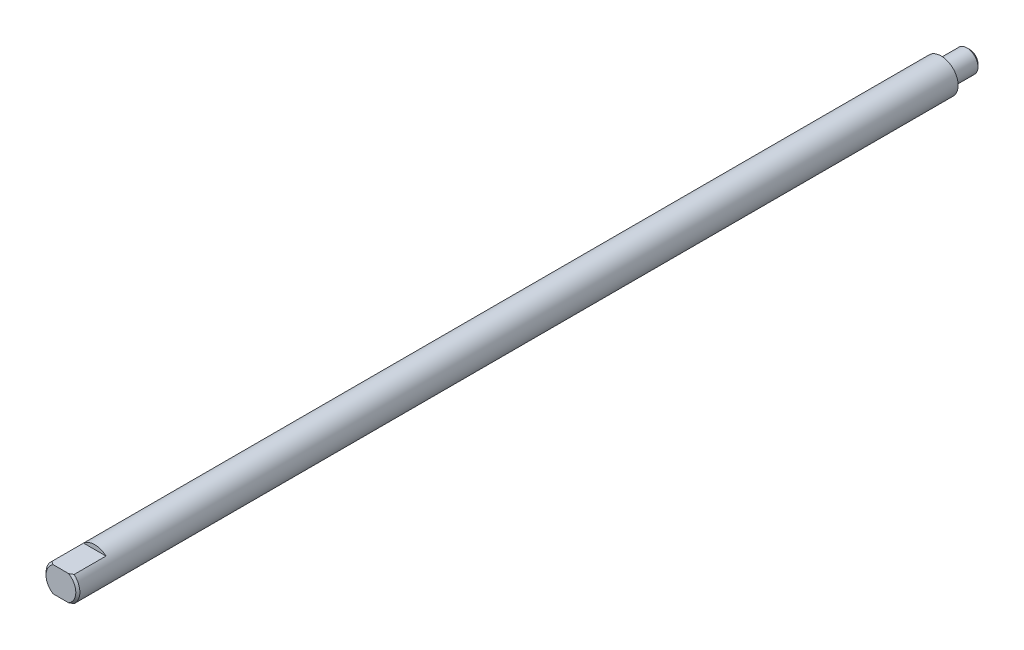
from build123d import *

# Parameters (mm, degrees)
SKETCH2_W          = 6.35
SKETCH2_H          = 0.8
CUT_EXTRUDE1_DEPTH = 5


with BuildPart() as part:
    # Sketch1 → Revolve1 (revolve)
    with BuildSketch(Plane(origin=(0, 0, 0), x_dir=(0, 0, -1), z_dir=(1, 0, 0)), mode=Mode.PRIVATE) as revolve1_sk:
        Polygon((166.37, 1.57), (165.86, 2.0828), (161.036, 2.0828), (161.036, 3.175), (-3.684, 3.175), (-4.064, 2.79), (-4.064, 0), (166.37, 0), align=None)
    revolve(revolve1_sk.sketch.rotate(Axis((0, 0, 4.064), (0, 0, -1)), 180), axis=Axis((0, 0, 4.064), (0, 0, -1)))

    # Sketch2 → Cut-Extrude1 (cut, symmetric)
    with BuildSketch(Plane(origin=(0, 0, 0), x_dir=(0, 0, -1), z_dir=(1, 0, 0))):
        with Locations((-0.889, 2.775)):
            Rectangle(SKETCH2_W, SKETCH2_H)
        with Locations((-0.889, -2.775)):
            Rectangle(SKETCH2_W, SKETCH2_H)
    extrude(amount=CUT_EXTRUDE1_DEPTH, both=True, mode=Mode.SUBTRACT)


solid = part.part
